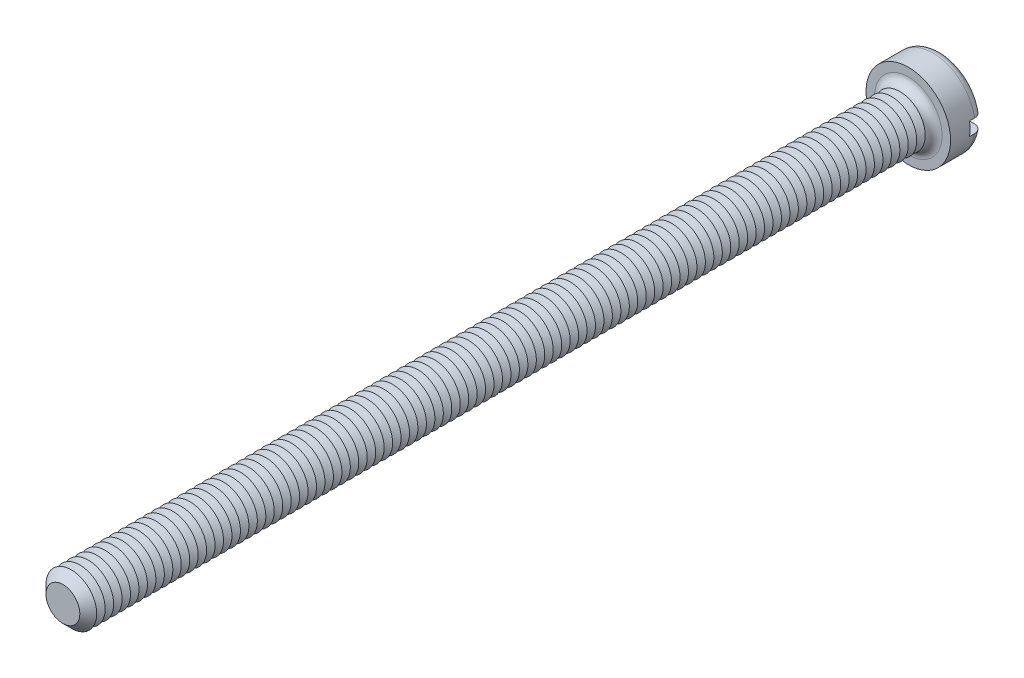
from build123d import *

# Parameters (mm, degrees)
SKETCH3_R           = 5
BOSS_EXTRUDE2_DEPTH = 3.9
SKETCH4_R           = 3
BOSS_EXTRUDE3_DEPTH = 100
FILLET1_R           = 1
CHAMFER1_SIZE       = 1
LPATTERN1_COUNT     = 98
LPATTERN1_PITCH     = 1
SKETCH8_W           = 10
SKETCH8_H           = 1.6
CUT_EXTRUDE1_DEPTH  = 1.6


with BuildPart() as part:
    # Sketch3 → Boss-Extrude2 (new body)
    with BuildSketch(Plane.XY):
        Circle(SKETCH3_R)
    extrude(amount=-BOSS_EXTRUDE2_DEPTH)

    # Sketch4 → Boss-Extrude3 (add)
    with BuildSketch(Plane.XY):
        Circle(SKETCH4_R)
    extrude(amount=BOSS_EXTRUDE3_DEPTH)

    # Fillet1
    fillet1_edges = [part.edges().sort_by_distance(p)[0] for p in [
        (-5, 0, -3.9),
        (-3, 0, 0),
    ]]
    fillet(fillet1_edges, radius=FILLET1_R)

    # Chamfer1
    chamfer1_edges = [part.edges().sort_by_distance(p)[0] for p in [
        (-3, 0, 100),
    ]]
    chamfer(chamfer1_edges, length=CHAMFER1_SIZE)

    # Sketch6 → Cut-Revolve1 (revolve, cut)
    with BuildSketch(Plane(origin=(0, 0, 0), x_dir=(0, 0, -1), z_dir=(1, 0, 0)), mode=Mode.PRIVATE) as cut_revolve1_sk:
        Polygon((-1, 3), (-1.5, 2.133974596), (-2, 3), align=None)
    cut_revolve1 = revolve(cut_revolve1_sk.sketch.rotate(Axis((0, 0, -1.694361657), (0, 0, 1)), 90), axis=Axis((0, 0, -1.694361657), (0, 0, 1)), mode=Mode.SUBTRACT)

    # LPattern1: Cut-Revolve1 ×98
    with Locations(*[(0, 0, i * LPATTERN1_PITCH) for i in range(1, LPATTERN1_COUNT)]):
        add(cut_revolve1, mode=Mode.SUBTRACT)

    # Sketch8 → Cut-Extrude1 (cut)
    with BuildSketch(Plane(origin=(0, 0, -3.9), x_dir=(-1, 0, 0), z_dir=(0, 0, -1))):
        Rectangle(SKETCH8_W, SKETCH8_H)
    extrude(amount=-CUT_EXTRUDE1_DEPTH, mode=Mode.SUBTRACT)


solid = part.part
